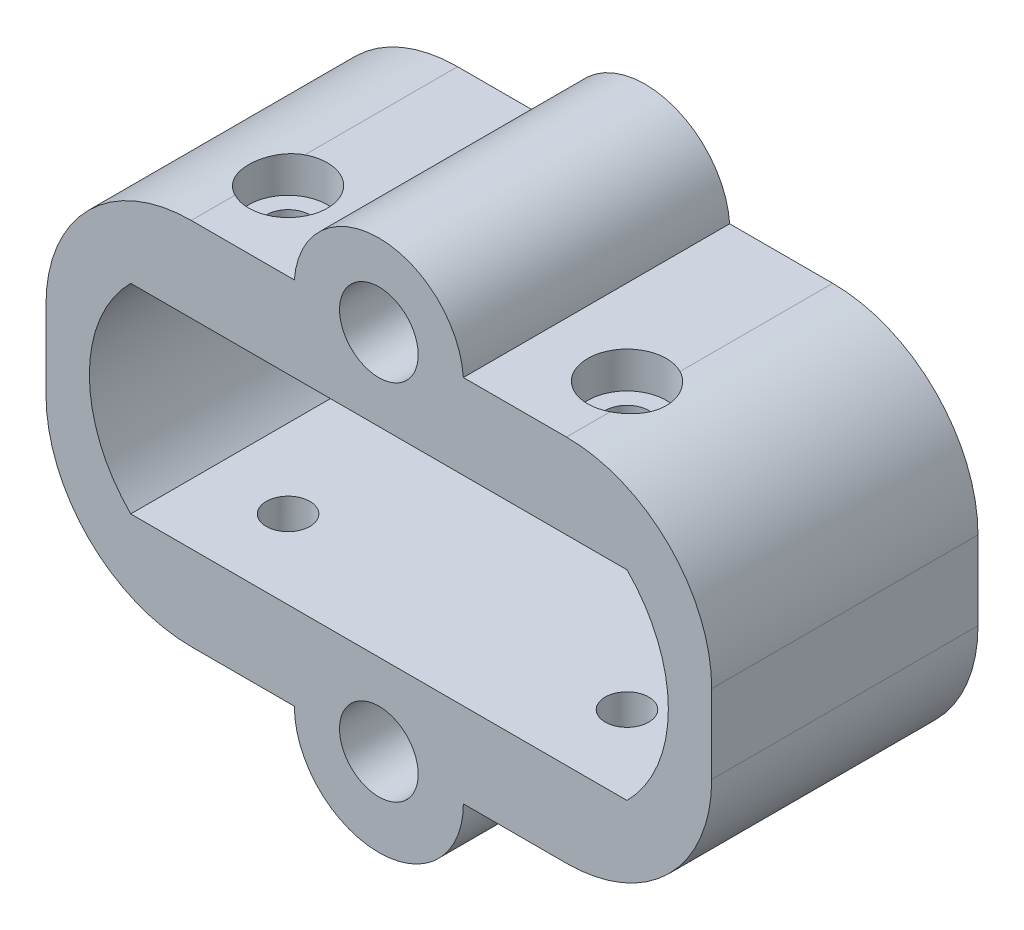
ISO-10303-21;
HEADER;
FILE_DESCRIPTION(('STEP AP214'),'2;1');
FILE_NAME('part.step','',(''),(''),'','','');
FILE_SCHEMA(('AUTOMOTIVE_DESIGN { 1 0 10303 214 1 1 1 1 }'));
ENDSEC;
DATA;
#1=APPLICATION_CONTEXT('core data for automotive mechanical design processes');
#2=APPLICATION_PROTOCOL_DEFINITION('international standard','automotive_design',2000,#1);
#3=PRODUCT_CONTEXT('',#1,'mechanical');
#4=PRODUCT('Part','Part','',(#3));
#5=PRODUCT_RELATED_PRODUCT_CATEGORY('part','',(#4));
#6=PRODUCT_DEFINITION_FORMATION('','',#4);
#7=PRODUCT_DEFINITION_CONTEXT('part definition',#1,'design');
#8=PRODUCT_DEFINITION('design','',#6,#7);
#9=PRODUCT_DEFINITION_SHAPE('','',#8);
#10=(LENGTH_UNIT() NAMED_UNIT(*) SI_UNIT(.MILLI.,.METRE.));
#11=(NAMED_UNIT(*) PLANE_ANGLE_UNIT() SI_UNIT($,.RADIAN.));
#12=(NAMED_UNIT(*) SI_UNIT($,.STERADIAN.) SOLID_ANGLE_UNIT());
#13=UNCERTAINTY_MEASURE_WITH_UNIT(LENGTH_MEASURE(1.E-05),#10,'distance_accuracy_value','');
#14=(GEOMETRIC_REPRESENTATION_CONTEXT(3) GLOBAL_UNCERTAINTY_ASSIGNED_CONTEXT((#13)) GLOBAL_UNIT_ASSIGNED_CONTEXT((#10,
#11,#12)) REPRESENTATION_CONTEXT('',''));
#15=CARTESIAN_POINT('',(0.,0.,0.));
#16=DIRECTION('',(0.,0.,1.));
#17=DIRECTION('',(1.,0.,0.));
#18=AXIS2_PLACEMENT_3D('',#15,#16,#17);
#19=CARTESIAN_POINT('',(0.,14.75,22.));
#20=DIRECTION('',(0.,0.,1.));
#21=DIRECTION('',(1.,0.,0.));
#22=AXIS2_PLACEMENT_3D('',#19,#20,#21);
#23=PLANE('',#22);
#24=CARTESIAN_POINT('',(0.,15.,22.));
#25=DIRECTION('',(0.,0.,1.));
#26=DIRECTION('',(1.,0.,0.));
#27=AXIS2_PLACEMENT_3D('',#24,#25,#26);
#28=CIRCLE('',#27,3.25);
#29=CARTESIAN_POINT('',(3.25,15.,22.));
#30=VERTEX_POINT('',#29);
#31=EDGE_CURVE('E487',#30,#30,#28,.T.);
#32=ORIENTED_EDGE('',*,*,#31,.F.);
#33=EDGE_LOOP('',(#32));
#34=FACE_BOUND('',#33,.T.);
#35=CARTESIAN_POINT('',(0.,-15.,22.));
#36=DIRECTION('',(0.,0.,1.));
#37=DIRECTION('',(1.,0.,0.));
#38=AXIS2_PLACEMENT_3D('',#35,#36,#37);
#39=CIRCLE('',#38,3.25);
#40=CARTESIAN_POINT('',(3.25,-15.,22.));
#41=VERTEX_POINT('',#40);
#42=EDGE_CURVE('E499',#41,#41,#39,.T.);
#43=ORIENTED_EDGE('',*,*,#42,.F.);
#44=EDGE_LOOP('',(#43));
#45=FACE_BOUND('',#44,.T.);
#46=CARTESIAN_POINT('',(0.,14.75,22.));
#47=DIRECTION('',(0.,0.,1.));
#48=DIRECTION('',(1.,0.,0.));
#49=AXIS2_PLACEMENT_3D('',#46,#47,#48);
#50=CIRCLE('',#49,7.);
#51=CARTESIAN_POINT('',(6.98212002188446,15.25,22.));
#52=VERTEX_POINT('',#51);
#53=CARTESIAN_POINT('',(-6.98212002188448,15.25,22.));
#54=VERTEX_POINT('',#53);
#55=EDGE_CURVE('E413',#52,#54,#50,.T.);
#56=ORIENTED_EDGE('',*,*,#55,.T.);
#57=DIRECTION('',(-1.,0.,0.));
#58=VECTOR('',#57,1.);
#59=CARTESIAN_POINT('',(-15.4999999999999,15.25,22.));
#60=LINE('',#59,#58);
#61=CARTESIAN_POINT('',(-15.4999999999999,15.25,22.));
#62=VERTEX_POINT('',#61);
#63=EDGE_CURVE('E416',#54,#62,#60,.T.);
#64=ORIENTED_EDGE('',*,*,#63,.T.);
#65=CARTESIAN_POINT('',(-15.5,3.25,22.));
#66=DIRECTION('',(0.,0.,1.));
#67=DIRECTION('',(1.,0.,0.));
#68=AXIS2_PLACEMENT_3D('',#65,#66,#67);
#69=CIRCLE('',#68,12.);
#70=CARTESIAN_POINT('',(-27.5,3.24999999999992,22.));
#71=VERTEX_POINT('',#70);
#72=EDGE_CURVE('E421',#62,#71,#69,.T.);
#73=ORIENTED_EDGE('',*,*,#72,.T.);
#74=DIRECTION('',(0.,-1.,0.));
#75=VECTOR('',#74,1.);
#76=CARTESIAN_POINT('',(-27.5,-3.24999999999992,22.));
#77=LINE('',#76,#75);
#78=CARTESIAN_POINT('',(-27.5,-3.24999999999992,22.));
#79=VERTEX_POINT('',#78);
#80=EDGE_CURVE('E428',#71,#79,#77,.T.);
#81=ORIENTED_EDGE('',*,*,#80,.T.);
#82=CARTESIAN_POINT('',(-15.5,-3.25,22.));
#83=DIRECTION('',(0.,0.,1.));
#84=DIRECTION('',(-1.,0.,0.));
#85=AXIS2_PLACEMENT_3D('',#82,#83,#84);
#86=CIRCLE('',#85,12.);
#87=CARTESIAN_POINT('',(-15.4999999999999,-15.25,22.));
#88=VERTEX_POINT('',#87);
#89=EDGE_CURVE('E394',#79,#88,#86,.T.);
#90=ORIENTED_EDGE('',*,*,#89,.T.);
#91=DIRECTION('',(1.,0.,0.));
#92=VECTOR('',#91,1.);
#93=CARTESIAN_POINT('',(-15.4999999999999,-15.25,22.));
#94=LINE('',#93,#92);
#95=CARTESIAN_POINT('',(-6.98212002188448,-15.25,22.));
#96=VERTEX_POINT('',#95);
#97=EDGE_CURVE('E431',#88,#96,#94,.T.);
#98=ORIENTED_EDGE('',*,*,#97,.T.);
#99=CARTESIAN_POINT('',(0.,-15.25,22.));
#100=DIRECTION('',(0.,0.,1.));
#101=DIRECTION('',(1.,0.,0.));
#102=AXIS2_PLACEMENT_3D('',#99,#100,#101);
#103=CIRCLE('',#102,6.98212002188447);
#104=CARTESIAN_POINT('',(6.98212002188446,-15.25,22.));
#105=VERTEX_POINT('',#104);
#106=EDGE_CURVE('E433',#96,#105,#103,.T.);
#107=ORIENTED_EDGE('',*,*,#106,.T.);
#108=DIRECTION('',(1.,0.,0.));
#109=VECTOR('',#108,1.);
#110=CARTESIAN_POINT('',(6.98212002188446,-15.25,22.));
#111=LINE('',#110,#109);
#112=CARTESIAN_POINT('',(15.4999999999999,-15.25,22.));
#113=VERTEX_POINT('',#112);
#114=EDGE_CURVE('E435',#105,#113,#111,.T.);
#115=ORIENTED_EDGE('',*,*,#114,.T.);
#116=CARTESIAN_POINT('',(15.5,-3.25,22.));
#117=DIRECTION('',(0.,0.,1.));
#118=DIRECTION('',(-1.,0.,0.));
#119=AXIS2_PLACEMENT_3D('',#116,#117,#118);
#120=CIRCLE('',#119,12.);
#121=CARTESIAN_POINT('',(27.5,-3.24999999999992,22.));
#122=VERTEX_POINT('',#121);
#123=EDGE_CURVE('E437',#113,#122,#120,.T.);
#124=ORIENTED_EDGE('',*,*,#123,.T.);
#125=DIRECTION('',(0.,1.,0.));
#126=VECTOR('',#125,1.);
#127=CARTESIAN_POINT('',(27.5,-3.24999999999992,22.));
#128=LINE('',#127,#126);
#129=CARTESIAN_POINT('',(27.5,3.24999999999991,22.));
#130=VERTEX_POINT('',#129);
#131=EDGE_CURVE('E439',#122,#130,#128,.T.);
#132=ORIENTED_EDGE('',*,*,#131,.T.);
#133=CARTESIAN_POINT('',(15.5,3.25,22.));
#134=DIRECTION('',(0.,0.,1.));
#135=DIRECTION('',(-1.,0.,0.));
#136=AXIS2_PLACEMENT_3D('',#133,#134,#135);
#137=CIRCLE('',#136,12.);
#138=CARTESIAN_POINT('',(15.4999999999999,15.25,22.));
#139=VERTEX_POINT('',#138);
#140=EDGE_CURVE('E441',#130,#139,#137,.T.);
#141=ORIENTED_EDGE('',*,*,#140,.T.);
#142=DIRECTION('',(-1.,0.,0.));
#143=VECTOR('',#142,1.);
#144=CARTESIAN_POINT('',(6.98212002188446,15.25,22.));
#145=LINE('',#144,#143);
#146=EDGE_CURVE('E190',#139,#52,#145,.T.);
#147=ORIENTED_EDGE('',*,*,#146,.T.);
#148=EDGE_LOOP('',(#56,#64,#73,#81,#90,#98,#107,#115,#124,#132,#141,#147));
#149=FACE_BOUND('',#148,.T.);
#150=DIRECTION('',(-1.,0.,0.));
#151=VECTOR('',#150,1.);
#152=CARTESIAN_POINT('',(-20.5,8.25,22.));
#153=LINE('',#152,#151);
#154=CARTESIAN_POINT('',(20.5,8.25,22.));
#155=VERTEX_POINT('',#154);
#156=CARTESIAN_POINT('',(-20.5,8.25,22.));
#157=VERTEX_POINT('',#156);
#158=EDGE_CURVE('E514',#155,#157,#153,.T.);
#159=ORIENTED_EDGE('',*,*,#158,.F.);
#160=CARTESIAN_POINT('',(12.25,0.,22.));
#161=DIRECTION('',(0.,0.,1.));
#162=DIRECTION('',(-1.,0.,0.));
#163=AXIS2_PLACEMENT_3D('',#160,#161,#162);
#164=CIRCLE('',#163,11.667261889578);
#165=CARTESIAN_POINT('',(20.5,-8.25,22.));
#166=VERTEX_POINT('',#165);
#167=EDGE_CURVE('E512',#166,#155,#164,.T.);
#168=ORIENTED_EDGE('',*,*,#167,.F.);
#169=DIRECTION('',(1.,0.,0.));
#170=VECTOR('',#169,1.);
#171=CARTESIAN_POINT('',(-20.5,-8.25,22.));
#172=LINE('',#171,#170);
#173=CARTESIAN_POINT('',(-20.5,-8.25,22.));
#174=VERTEX_POINT('',#173);
#175=EDGE_CURVE('E520',#174,#166,#172,.T.);
#176=ORIENTED_EDGE('',*,*,#175,.F.);
#177=CARTESIAN_POINT('',(-12.25,0.,22.));
#178=DIRECTION('',(0.,0.,1.));
#179=DIRECTION('',(1.,0.,0.));
#180=AXIS2_PLACEMENT_3D('',#177,#178,#179);
#181=CIRCLE('',#180,11.667261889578);
#182=EDGE_CURVE('E517',#157,#174,#181,.T.);
#183=ORIENTED_EDGE('',*,*,#182,.F.);
#184=EDGE_LOOP('',(#159,#168,#176,#183));
#185=FACE_BOUND('',#184,.T.);
#186=ADVANCED_FACE('F34',(#34,#45,#149,#185),#23,.T.);
#187=CARTESIAN_POINT('',(0.,14.75,0.));
#188=DIRECTION('',(0.,0.,1.));
#189=DIRECTION('',(1.,0.,0.));
#190=AXIS2_PLACEMENT_3D('',#187,#188,#189);
#191=PLANE('',#190);
#192=CARTESIAN_POINT('',(0.,15.,0.));
#193=DIRECTION('',(0.,0.,1.));
#194=DIRECTION('',(1.,0.,0.));
#195=AXIS2_PLACEMENT_3D('',#192,#193,#194);
#196=CIRCLE('',#195,1.79999999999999);
#197=CARTESIAN_POINT('',(1.79999999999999,15.,0.));
#198=VERTEX_POINT('',#197);
#199=EDGE_CURVE('E496',#198,#198,#196,.T.);
#200=ORIENTED_EDGE('',*,*,#199,.T.);
#201=EDGE_LOOP('',(#200));
#202=FACE_BOUND('',#201,.T.);
#203=CARTESIAN_POINT('',(0.,-15.,0.));
#204=DIRECTION('',(0.,0.,1.));
#205=DIRECTION('',(1.,0.,0.));
#206=AXIS2_PLACEMENT_3D('',#203,#204,#205);
#207=CIRCLE('',#206,1.79999999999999);
#208=CARTESIAN_POINT('',(1.8,-15.,0.));
#209=VERTEX_POINT('',#208);
#210=EDGE_CURVE('E508',#209,#209,#207,.T.);
#211=ORIENTED_EDGE('',*,*,#210,.T.);
#212=EDGE_LOOP('',(#211));
#213=FACE_BOUND('',#212,.T.);
#214=CARTESIAN_POINT('',(0.,14.75,0.));
#215=DIRECTION('',(0.,0.,1.));
#216=DIRECTION('',(1.,0.,0.));
#217=AXIS2_PLACEMENT_3D('',#214,#215,#216);
#218=CIRCLE('',#217,7.);
#219=CARTESIAN_POINT('',(6.98212002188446,15.25,0.));
#220=VERTEX_POINT('',#219);
#221=CARTESIAN_POINT('',(-6.98212002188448,15.25,0.));
#222=VERTEX_POINT('',#221);
#223=EDGE_CURVE('E444',#220,#222,#218,.T.);
#224=ORIENTED_EDGE('',*,*,#223,.F.);
#225=DIRECTION('',(-1.,0.,0.));
#226=VECTOR('',#225,1.);
#227=CARTESIAN_POINT('',(6.98212002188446,15.25,0.));
#228=LINE('',#227,#226);
#229=CARTESIAN_POINT('',(15.4999999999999,15.25,0.));
#230=VERTEX_POINT('',#229);
#231=EDGE_CURVE('E412',#230,#220,#228,.T.);
#232=ORIENTED_EDGE('',*,*,#231,.F.);
#233=CARTESIAN_POINT('',(15.5,3.25,0.));
#234=DIRECTION('',(0.,0.,1.));
#235=DIRECTION('',(-1.,0.,0.));
#236=AXIS2_PLACEMENT_3D('',#233,#234,#235);
#237=CIRCLE('',#236,12.);
#238=CARTESIAN_POINT('',(27.5,3.24999999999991,0.));
#239=VERTEX_POINT('',#238);
#240=EDGE_CURVE('E184',#239,#230,#237,.T.);
#241=ORIENTED_EDGE('',*,*,#240,.F.);
#242=DIRECTION('',(0.,1.,0.));
#243=VECTOR('',#242,1.);
#244=CARTESIAN_POINT('',(27.5,-3.24999999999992,0.));
#245=LINE('',#244,#243);
#246=CARTESIAN_POINT('',(27.5,-3.24999999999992,0.));
#247=VERTEX_POINT('',#246);
#248=EDGE_CURVE('E410',#247,#239,#245,.T.);
#249=ORIENTED_EDGE('',*,*,#248,.F.);
#250=CARTESIAN_POINT('',(15.5,-3.25,0.));
#251=DIRECTION('',(0.,0.,1.));
#252=DIRECTION('',(-1.,0.,0.));
#253=AXIS2_PLACEMENT_3D('',#250,#251,#252);
#254=CIRCLE('',#253,12.);
#255=CARTESIAN_POINT('',(15.4999999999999,-15.25,0.));
#256=VERTEX_POINT('',#255);
#257=EDGE_CURVE('E408',#256,#247,#254,.T.);
#258=ORIENTED_EDGE('',*,*,#257,.F.);
#259=DIRECTION('',(1.,0.,0.));
#260=VECTOR('',#259,1.);
#261=CARTESIAN_POINT('',(6.98212002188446,-15.25,0.));
#262=LINE('',#261,#260);
#263=CARTESIAN_POINT('',(6.98212002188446,-15.25,0.));
#264=VERTEX_POINT('',#263);
#265=EDGE_CURVE('E405',#264,#256,#262,.T.);
#266=ORIENTED_EDGE('',*,*,#265,.F.);
#267=CARTESIAN_POINT('',(0.,-15.25,0.));
#268=DIRECTION('',(0.,0.,1.));
#269=DIRECTION('',(1.,0.,0.));
#270=AXIS2_PLACEMENT_3D('',#267,#268,#269);
#271=CIRCLE('',#270,6.98212002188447);
#272=CARTESIAN_POINT('',(-6.98212002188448,-15.25,0.));
#273=VERTEX_POINT('',#272);
#274=EDGE_CURVE('E400',#273,#264,#271,.T.);
#275=ORIENTED_EDGE('',*,*,#274,.F.);
#276=DIRECTION('',(1.,0.,0.));
#277=VECTOR('',#276,1.);
#278=CARTESIAN_POINT('',(-15.4999999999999,-15.25,0.));
#279=LINE('',#278,#277);
#280=CARTESIAN_POINT('',(-15.4999999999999,-15.25,0.));
#281=VERTEX_POINT('',#280);
#282=EDGE_CURVE('E398',#281,#273,#279,.T.);
#283=ORIENTED_EDGE('',*,*,#282,.F.);
#284=CARTESIAN_POINT('',(-15.5,-3.25,0.));
#285=DIRECTION('',(0.,0.,1.));
#286=DIRECTION('',(-1.,0.,0.));
#287=AXIS2_PLACEMENT_3D('',#284,#285,#286);
#288=CIRCLE('',#287,12.);
#289=CARTESIAN_POINT('',(-27.5,-3.24999999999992,0.));
#290=VERTEX_POINT('',#289);
#291=EDGE_CURVE('E387',#290,#281,#288,.T.);
#292=ORIENTED_EDGE('',*,*,#291,.F.);
#293=DIRECTION('',(0.,-1.,0.));
#294=VECTOR('',#293,1.);
#295=CARTESIAN_POINT('',(-27.5,-3.24999999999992,0.));
#296=LINE('',#295,#294);
#297=CARTESIAN_POINT('',(-27.5,3.24999999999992,0.));
#298=VERTEX_POINT('',#297);
#299=EDGE_CURVE('E380',#298,#290,#296,.T.);
#300=ORIENTED_EDGE('',*,*,#299,.F.);
#301=CARTESIAN_POINT('',(-15.5,3.25,0.));
#302=DIRECTION('',(0.,0.,1.));
#303=DIRECTION('',(1.,0.,0.));
#304=AXIS2_PLACEMENT_3D('',#301,#302,#303);
#305=CIRCLE('',#304,12.);
#306=CARTESIAN_POINT('',(-15.4999999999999,15.25,0.));
#307=VERTEX_POINT('',#306);
#308=EDGE_CURVE('E388',#307,#298,#305,.T.);
#309=ORIENTED_EDGE('',*,*,#308,.F.);
#310=DIRECTION('',(-1.,0.,0.));
#311=VECTOR('',#310,1.);
#312=CARTESIAN_POINT('',(-15.4999999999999,15.25,0.));
#313=LINE('',#312,#311);
#314=EDGE_CURVE('E447',#222,#307,#313,.T.);
#315=ORIENTED_EDGE('',*,*,#314,.F.);
#316=EDGE_LOOP('',(#224,#232,#241,#249,#258,#266,#275,#283,#292,#300,#309,#315));
#317=FACE_BOUND('',#316,.T.);
#318=CARTESIAN_POINT('',(12.25,0.,0.));
#319=DIRECTION('',(0.,0.,1.));
#320=DIRECTION('',(-1.,0.,0.));
#321=AXIS2_PLACEMENT_3D('',#318,#319,#320);
#322=CIRCLE('',#321,11.667261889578);
#323=CARTESIAN_POINT('',(20.5,-8.25,0.));
#324=VERTEX_POINT('',#323);
#325=CARTESIAN_POINT('',(20.5,8.25,0.));
#326=VERTEX_POINT('',#325);
#327=EDGE_CURVE('E511',#324,#326,#322,.T.);
#328=ORIENTED_EDGE('',*,*,#327,.T.);
#329=DIRECTION('',(-1.,0.,0.));
#330=VECTOR('',#329,1.);
#331=CARTESIAN_POINT('',(-20.5,8.25,0.));
#332=LINE('',#331,#330);
#333=CARTESIAN_POINT('',(-20.5,8.25,0.));
#334=VERTEX_POINT('',#333);
#335=EDGE_CURVE('E525',#326,#334,#332,.T.);
#336=ORIENTED_EDGE('',*,*,#335,.T.);
#337=CARTESIAN_POINT('',(-12.25,0.,0.));
#338=DIRECTION('',(0.,0.,1.));
#339=DIRECTION('',(1.,0.,0.));
#340=AXIS2_PLACEMENT_3D('',#337,#338,#339);
#341=CIRCLE('',#340,11.667261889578);
#342=CARTESIAN_POINT('',(-20.5,-8.25,0.));
#343=VERTEX_POINT('',#342);
#344=EDGE_CURVE('E528',#334,#343,#341,.T.);
#345=ORIENTED_EDGE('',*,*,#344,.T.);
#346=DIRECTION('',(1.,0.,0.));
#347=VECTOR('',#346,1.);
#348=CARTESIAN_POINT('',(-20.5,-8.25,0.));
#349=LINE('',#348,#347);
#350=EDGE_CURVE('E515',#343,#324,#349,.T.);
#351=ORIENTED_EDGE('',*,*,#350,.T.);
#352=EDGE_LOOP('',(#328,#336,#345,#351));
#353=FACE_BOUND('',#352,.T.);
#354=ADVANCED_FACE('F303',(#202,#213,#317,#353),#191,.F.);
#355=CARTESIAN_POINT('',(0.,14.75,22.));
#356=DIRECTION('',(0.,0.,-1.));
#357=DIRECTION('',(-1.,0.,0.));
#358=AXIS2_PLACEMENT_3D('',#355,#356,#357);
#359=CYLINDRICAL_SURFACE('',#358,7.);
#360=ORIENTED_EDGE('',*,*,#223,.T.);
#361=DIRECTION('',(0.,0.,-1.));
#362=VECTOR('',#361,1.);
#363=CARTESIAN_POINT('',(-6.98212002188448,15.25,22.));
#364=LINE('',#363,#362);
#365=EDGE_CURVE('E222',#54,#222,#364,.T.);
#366=ORIENTED_EDGE('',*,*,#365,.F.);
#367=ORIENTED_EDGE('',*,*,#55,.F.);
#368=DIRECTION('',(0.,0.,-1.));
#369=VECTOR('',#368,1.);
#370=CARTESIAN_POINT('',(6.98212002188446,15.25,22.));
#371=LINE('',#370,#369);
#372=EDGE_CURVE('E186',#52,#220,#371,.T.);
#373=ORIENTED_EDGE('',*,*,#372,.T.);
#374=EDGE_LOOP('',(#360,#366,#367,#373));
#375=FACE_BOUND('',#374,.T.);
#376=ADVANCED_FACE('F36',(#375),#359,.T.);
#377=CARTESIAN_POINT('',(-15.4999999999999,15.25,22.));
#378=DIRECTION('',(0.,-1.,0.));
#379=DIRECTION('',(0.,0.,-1.));
#380=AXIS2_PLACEMENT_3D('',#377,#378,#379);
#381=PLANE('',#380);
#382=DIRECTION('',(0.,0.,-1.));
#383=VECTOR('',#382,1.);
#384=CARTESIAN_POINT('',(-15.4999999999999,15.25,22.));
#385=LINE('',#384,#383);
#386=CARTESIAN_POINT('',(-15.4999999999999,15.25,12.6168593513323));
#387=VERTEX_POINT('',#386);
#388=EDGE_CURVE('E218',#387,#307,#385,.T.);
#389=ORIENTED_EDGE('',*,*,#388,.F.);
#390=CARTESIAN_POINT('',(-14.,15.25,15.5));
#391=DIRECTION('',(0.,1.,0.));
#392=DIRECTION('',(0.,0.,1.));
#393=AXIS2_PLACEMENT_3D('',#390,#391,#392);
#394=CIRCLE('',#393,3.25);
#395=CARTESIAN_POINT('',(-15.5,15.25,18.3831406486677));
#396=VERTEX_POINT('',#395);
#397=EDGE_CURVE('E572',#396,#387,#394,.T.);
#398=ORIENTED_EDGE('',*,*,#397,.F.);
#399=EDGE_CURVE('E219',#62,#396,#385,.T.);
#400=ORIENTED_EDGE('',*,*,#399,.F.);
#401=ORIENTED_EDGE('',*,*,#63,.F.);
#402=ORIENTED_EDGE('',*,*,#365,.T.);
#403=ORIENTED_EDGE('',*,*,#314,.T.);
#404=EDGE_LOOP('',(#389,#398,#400,#401,#402,#403));
#405=FACE_BOUND('',#404,.T.);
#406=ADVANCED_FACE('F376',(#405),#381,.F.);
#407=CARTESIAN_POINT('',(-15.5,3.25,22.));
#408=DIRECTION('',(0.,0.,-1.));
#409=DIRECTION('',(-1.,0.,0.));
#410=AXIS2_PLACEMENT_3D('',#407,#408,#409);
#411=CYLINDRICAL_SURFACE('',#410,12.);
#412=ORIENTED_EDGE('',*,*,#399,.T.);
#413=CARTESIAN_POINT('',(-15.4999999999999,15.25,18.3831406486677));
#414=CARTESIAN_POINT('',(-15.5807260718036,15.2500049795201,18.3411523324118));
#415=CARTESIAN_POINT('',(-15.6596718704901,15.249185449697,18.2957612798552));
#416=CARTESIAN_POINT('',(-15.8134520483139,15.2461506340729,18.1985457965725));
#417=CARTESIAN_POINT('',(-15.8882871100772,15.2439355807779,18.1467224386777));
#418=CARTESIAN_POINT('',(-16.0332417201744,15.238365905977,18.0370610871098));
#419=CARTESIAN_POINT('',(-16.1033664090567,15.2350125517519,17.9792298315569));
#420=CARTESIAN_POINT('',(-16.2384912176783,15.2274459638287,17.857946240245));
#421=CARTESIAN_POINT('',(-16.303491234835,15.2232327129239,17.794493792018));
#422=CARTESIAN_POINT('',(-16.4901181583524,15.2097327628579,17.5963443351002));
#423=CARTESIAN_POINT('',(-16.6035022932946,15.1995799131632,17.453756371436));
#424=CARTESIAN_POINT('',(-16.8048504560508,15.1792776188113,17.1517561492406));
#425=CARTESIAN_POINT('',(-16.8928149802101,15.1691281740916,16.9923442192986));
#426=CARTESIAN_POINT('',(-17.0415973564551,15.1508051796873,16.6595894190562));
#427=CARTESIAN_POINT('',(-17.1021858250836,15.1426485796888,16.4861426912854));
#428=CARTESIAN_POINT('',(-17.1933347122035,15.1300152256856,16.1313928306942));
#429=CARTESIAN_POINT('',(-17.2238943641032,15.1255385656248,15.9500894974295));
#430=CARTESIAN_POINT('',(-17.2539385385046,15.1211386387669,15.5862712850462));
#431=CARTESIAN_POINT('',(-17.2536595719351,15.1211807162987,15.4037763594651));
#432=CARTESIAN_POINT('',(-17.2226239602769,15.1257233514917,15.0414699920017));
#433=CARTESIAN_POINT('',(-17.1918696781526,15.1302235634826,14.8616583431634));
#434=CARTESIAN_POINT('',(-17.101034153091,15.1428028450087,14.5106555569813));
#435=CARTESIAN_POINT('',(-17.0410919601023,15.150864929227,14.3394277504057));
#436=CARTESIAN_POINT('',(-16.89363662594,15.1690294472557,14.0093467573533));
#437=CARTESIAN_POINT('',(-16.8061153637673,15.1791324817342,13.8504972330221));
#438=CARTESIAN_POINT('',(-16.6049233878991,15.1994540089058,13.5480220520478));
#439=CARTESIAN_POINT('',(-16.4909976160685,15.2096726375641,13.4045662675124));
#440=CARTESIAN_POINT('',(-16.2406551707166,15.2277745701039,13.1388137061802));
#441=CARTESIAN_POINT('',(-16.1042635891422,15.235660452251,13.0164936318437));
#442=CARTESIAN_POINT('',(-15.8863830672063,15.2439968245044,12.8519260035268));
#443=CARTESIAN_POINT('',(-15.8118260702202,15.2461918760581,12.8003707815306));
#444=CARTESIAN_POINT('',(-15.6587710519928,15.2491938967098,12.7037256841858));
#445=CARTESIAN_POINT('',(-15.5802793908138,15.2500030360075,12.6586258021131));
#446=CARTESIAN_POINT('',(-15.4999999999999,15.25,12.6168593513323));
#447=B_SPLINE_CURVE_WITH_KNOTS('',3,(#413,#414,#415,#416,#417,#418,#419,#420,#421,#422,#423,
#424,#425,#426,#427,#428,#429,#430,#431,#432,#433,#434,#435,#436,#437,#438,#439,#440,#441,#442,
#443,#444,#445,#446),.UNSPECIFIED.,.F.,.F.,(4,2,2,2,2,2,2,2,2,2,2,2,2,2,2,2,4),(0.,
0.272880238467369,0.545715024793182,0.818247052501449,1.09078453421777,1.63537453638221,
2.17995390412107,2.72901531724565,3.27809074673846,3.8229554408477,4.36777789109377,
4.91002985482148,5.45244164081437,6.00032904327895,6.54760861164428,6.81934296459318,
7.09065141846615),.UNSPECIFIED.);
#448=EDGE_CURVE('E225',#396,#387,#447,.T.);
#449=ORIENTED_EDGE('',*,*,#448,.T.);
#450=ORIENTED_EDGE('',*,*,#388,.T.);
#451=ORIENTED_EDGE('',*,*,#308,.T.);
#452=DIRECTION('',(0.,0.,-1.));
#453=VECTOR('',#452,1.);
#454=CARTESIAN_POINT('',(-27.5,3.24999999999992,22.));
#455=LINE('',#454,#453);
#456=EDGE_CURVE('E215',#71,#298,#455,.T.);
#457=ORIENTED_EDGE('',*,*,#456,.F.);
#458=ORIENTED_EDGE('',*,*,#72,.F.);
#459=EDGE_LOOP('',(#412,#449,#450,#451,#457,#458));
#460=FACE_BOUND('',#459,.T.);
#461=ADVANCED_FACE('F240',(#460),#411,.T.);
#462=CARTESIAN_POINT('',(-27.5,-3.24999999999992,22.));
#463=DIRECTION('',(1.,0.,0.));
#464=DIRECTION('',(0.,0.,-1.));
#465=AXIS2_PLACEMENT_3D('',#462,#463,#464);
#466=PLANE('',#465);
#467=ORIENTED_EDGE('',*,*,#299,.T.);
#468=DIRECTION('',(0.,0.,-1.));
#469=VECTOR('',#468,1.);
#470=CARTESIAN_POINT('',(-27.5,-3.24999999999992,22.));
#471=LINE('',#470,#469);
#472=EDGE_CURVE('E212',#79,#290,#471,.T.);
#473=ORIENTED_EDGE('',*,*,#472,.F.);
#474=ORIENTED_EDGE('',*,*,#80,.F.);
#475=ORIENTED_EDGE('',*,*,#456,.T.);
#476=EDGE_LOOP('',(#467,#473,#474,#475));
#477=FACE_BOUND('',#476,.T.);
#478=ADVANCED_FACE('F369',(#477),#466,.F.);
#479=CARTESIAN_POINT('',(-15.5,-3.25,22.));
#480=DIRECTION('',(0.,0.,-1.));
#481=DIRECTION('',(-1.,0.,0.));
#482=AXIS2_PLACEMENT_3D('',#479,#480,#481);
#483=CYLINDRICAL_SURFACE('',#482,12.);
#484=DIRECTION('',(0.,0.,-1.));
#485=VECTOR('',#484,1.);
#486=CARTESIAN_POINT('',(-15.4999999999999,-15.25,22.));
#487=LINE('',#486,#485);
#488=CARTESIAN_POINT('',(-15.4999999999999,-15.25,14.5050125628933));
#489=VERTEX_POINT('',#488);
#490=EDGE_CURVE('E208',#489,#281,#487,.T.);
#491=ORIENTED_EDGE('',*,*,#490,.F.);
#492=CARTESIAN_POINT('',(-15.4999999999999,-15.25,14.5050125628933));
#493=CARTESIAN_POINT('',(-15.5279920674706,-15.2499992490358,14.5472128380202));
#494=CARTESIAN_POINT('',(-15.5541892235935,-15.2499021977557,14.5905743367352));
#495=CARTESIAN_POINT('',(-15.6028386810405,-15.2495840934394,14.6793462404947));
#496=CARTESIAN_POINT('',(-15.6252911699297,-15.2493630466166,14.7247565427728));
#497=CARTESIAN_POINT('',(-15.6867348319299,-15.2486176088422,14.8635028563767));
#498=CARTESIAN_POINT('',(-15.7199063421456,-15.248010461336,14.9594965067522));
#499=CARTESIAN_POINT('',(-15.7696616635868,-15.2469957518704,15.1556785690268));
#500=CARTESIAN_POINT('',(-15.7862390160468,-15.2465882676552,15.2558685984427));
#501=CARTESIAN_POINT('',(-15.8023423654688,-15.2461933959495,15.4576289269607));
#502=CARTESIAN_POINT('',(-15.8018680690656,-15.2462060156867,15.5591992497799));
#503=CARTESIAN_POINT('',(-15.7838790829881,-15.2466450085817,15.7608278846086));
#504=CARTESIAN_POINT('',(-15.7663599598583,-15.247071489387,15.8608857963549));
#505=CARTESIAN_POINT('',(-15.7147629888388,-15.248105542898,16.0566015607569));
#506=CARTESIAN_POINT('',(-15.6806994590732,-15.2487129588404,16.1522631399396));
#507=CARTESIAN_POINT('',(-15.619111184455,-15.2494248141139,16.2878964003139));
#508=CARTESIAN_POINT('',(-15.5975815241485,-15.2496257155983,16.3306784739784));
#509=CARTESIAN_POINT('',(-15.5512295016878,-15.249912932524,16.4143112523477));
#510=CARTESIAN_POINT('',(-15.526413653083,-15.2499994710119,16.455165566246));
#511=CARTESIAN_POINT('',(-15.4999999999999,-15.25,16.4949874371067));
#512=B_SPLINE_CURVE_WITH_KNOTS('',3,(#492,#493,#494,#495,#496,#497,#498,#499,#500,#501,#502,
#503,#504,#505,#506,#507,#508,#509,#510,#511),.UNSPECIFIED.,.F.,.F.,(4,2,2,2,2,2,2,2,2,4),(0.,
0.151826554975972,0.303645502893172,0.606778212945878,0.910028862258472,1.21328472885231,
1.51661949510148,1.81969221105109,1.96324605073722,2.10651949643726),.UNSPECIFIED.);
#513=CARTESIAN_POINT('',(-15.4999999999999,-15.25,16.4949874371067));
#514=VERTEX_POINT('',#513);
#515=EDGE_CURVE('E43',#489,#514,#512,.T.);
#516=ORIENTED_EDGE('',*,*,#515,.T.);
#517=EDGE_CURVE('E209',#88,#514,#487,.T.);
#518=ORIENTED_EDGE('',*,*,#517,.F.);
#519=ORIENTED_EDGE('',*,*,#89,.F.);
#520=ORIENTED_EDGE('',*,*,#472,.T.);
#521=ORIENTED_EDGE('',*,*,#291,.T.);
#522=EDGE_LOOP('',(#491,#516,#518,#519,#520,#521));
#523=FACE_BOUND('',#522,.T.);
#524=ADVANCED_FACE('F365',(#523),#483,.T.);
#525=CARTESIAN_POINT('',(-15.4999999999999,-15.25,22.));
#526=DIRECTION('',(0.,1.,0.));
#527=DIRECTION('',(0.,0.,1.));
#528=AXIS2_PLACEMENT_3D('',#525,#526,#527);
#529=PLANE('',#528);
#530=ORIENTED_EDGE('',*,*,#517,.T.);
#531=CARTESIAN_POINT('',(-14.,-15.25,15.5));
#532=DIRECTION('',(0.,1.,0.));
#533=DIRECTION('',(0.,0.,1.));
#534=AXIS2_PLACEMENT_3D('',#531,#532,#533);
#535=CIRCLE('',#534,1.8);
#536=EDGE_CURVE('E471',#514,#489,#535,.T.);
#537=ORIENTED_EDGE('',*,*,#536,.T.);
#538=ORIENTED_EDGE('',*,*,#490,.T.);
#539=ORIENTED_EDGE('',*,*,#282,.T.);
#540=DIRECTION('',(0.,0.,-1.));
#541=VECTOR('',#540,1.);
#542=CARTESIAN_POINT('',(-6.98212002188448,-15.25,22.));
#543=LINE('',#542,#541);
#544=EDGE_CURVE('E205',#96,#273,#543,.T.);
#545=ORIENTED_EDGE('',*,*,#544,.F.);
#546=ORIENTED_EDGE('',*,*,#97,.F.);
#547=EDGE_LOOP('',(#530,#537,#538,#539,#545,#546));
#548=FACE_BOUND('',#547,.T.);
#549=ADVANCED_FACE('F362',(#548),#529,.F.);
#550=CARTESIAN_POINT('',(0.,-15.25,22.));
#551=DIRECTION('',(0.,0.,-1.));
#552=DIRECTION('',(-1.,0.,0.));
#553=AXIS2_PLACEMENT_3D('',#550,#551,#552);
#554=CYLINDRICAL_SURFACE('',#553,6.98212002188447);
#555=ORIENTED_EDGE('',*,*,#274,.T.);
#556=DIRECTION('',(0.,0.,-1.));
#557=VECTOR('',#556,1.);
#558=CARTESIAN_POINT('',(6.98212002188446,-15.25,22.));
#559=LINE('',#558,#557);
#560=EDGE_CURVE('E202',#105,#264,#559,.T.);
#561=ORIENTED_EDGE('',*,*,#560,.F.);
#562=ORIENTED_EDGE('',*,*,#106,.F.);
#563=ORIENTED_EDGE('',*,*,#544,.T.);
#564=EDGE_LOOP('',(#555,#561,#562,#563));
#565=FACE_BOUND('',#564,.T.);
#566=ADVANCED_FACE('F358',(#565),#554,.T.);
#567=CARTESIAN_POINT('',(6.98212002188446,-15.25,22.));
#568=DIRECTION('',(0.,1.,0.));
#569=DIRECTION('',(0.,0.,1.));
#570=AXIS2_PLACEMENT_3D('',#567,#568,#569);
#571=PLANE('',#570);
#572=DIRECTION('',(0.,0.,-1.));
#573=VECTOR('',#572,1.);
#574=CARTESIAN_POINT('',(15.4999999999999,-15.25,22.));
#575=LINE('',#574,#573);
#576=CARTESIAN_POINT('',(15.4999999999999,-15.25,14.5050125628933));
#577=VERTEX_POINT('',#576);
#578=EDGE_CURVE('E198',#577,#256,#575,.T.);
#579=ORIENTED_EDGE('',*,*,#578,.F.);
#580=CARTESIAN_POINT('',(14.,-15.25,15.5));
#581=DIRECTION('',(0.,1.,0.));
#582=DIRECTION('',(0.,0.,1.));
#583=AXIS2_PLACEMENT_3D('',#580,#581,#582);
#584=CIRCLE('',#583,1.8);
#585=CARTESIAN_POINT('',(15.4999999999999,-15.25,16.4949874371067));
#586=VERTEX_POINT('',#585);
#587=EDGE_CURVE('E49',#577,#586,#584,.T.);
#588=ORIENTED_EDGE('',*,*,#587,.T.);
#589=EDGE_CURVE('E199',#113,#586,#575,.T.);
#590=ORIENTED_EDGE('',*,*,#589,.F.);
#591=ORIENTED_EDGE('',*,*,#114,.F.);
#592=ORIENTED_EDGE('',*,*,#560,.T.);
#593=ORIENTED_EDGE('',*,*,#265,.T.);
#594=EDGE_LOOP('',(#579,#588,#590,#591,#592,#593));
#595=FACE_BOUND('',#594,.T.);
#596=ADVANCED_FACE('F354',(#595),#571,.F.);
#597=CARTESIAN_POINT('',(15.5,-3.25,22.));
#598=DIRECTION('',(0.,0.,-1.));
#599=DIRECTION('',(-1.,0.,0.));
#600=AXIS2_PLACEMENT_3D('',#597,#598,#599);
#601=CYLINDRICAL_SURFACE('',#600,12.);
#602=ORIENTED_EDGE('',*,*,#589,.T.);
#603=CARTESIAN_POINT('',(15.4999999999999,-15.25,16.4949874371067));
#604=CARTESIAN_POINT('',(15.5279920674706,-15.2499992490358,16.4527871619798));
#605=CARTESIAN_POINT('',(15.5541892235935,-15.2499021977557,16.4094256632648));
#606=CARTESIAN_POINT('',(15.6028386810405,-15.2495840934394,16.3206537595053));
#607=CARTESIAN_POINT('',(15.6252911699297,-15.2493630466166,16.2752434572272));
#608=CARTESIAN_POINT('',(15.6867348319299,-15.2486176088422,16.1364971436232));
#609=CARTESIAN_POINT('',(15.7199063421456,-15.248010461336,16.0405034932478));
#610=CARTESIAN_POINT('',(15.7696616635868,-15.2469957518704,15.8443214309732));
#611=CARTESIAN_POINT('',(15.7862390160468,-15.2465882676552,15.7441314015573));
#612=CARTESIAN_POINT('',(15.8023423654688,-15.2461933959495,15.5423710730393));
#613=CARTESIAN_POINT('',(15.8018680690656,-15.2462060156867,15.4408007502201));
#614=CARTESIAN_POINT('',(15.7838790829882,-15.2466450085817,15.2391721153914));
#615=CARTESIAN_POINT('',(15.7663599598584,-15.247071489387,15.1391142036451));
#616=CARTESIAN_POINT('',(15.7147629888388,-15.248105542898,14.9433984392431));
#617=CARTESIAN_POINT('',(15.6806994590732,-15.2487129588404,14.8477368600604));
#618=CARTESIAN_POINT('',(15.619111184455,-15.2494248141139,14.7121035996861));
#619=CARTESIAN_POINT('',(15.5975815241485,-15.2496257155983,14.6693215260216));
#620=CARTESIAN_POINT('',(15.5512295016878,-15.249912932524,14.5856887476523));
#621=CARTESIAN_POINT('',(15.526413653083,-15.2499994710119,14.544834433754));
#622=CARTESIAN_POINT('',(15.4999999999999,-15.25,14.5050125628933));
#623=B_SPLINE_CURVE_WITH_KNOTS('',3,(#603,#604,#605,#606,#607,#608,#609,#610,#611,#612,#613,
#614,#615,#616,#617,#618,#619,#620,#621,#622),.UNSPECIFIED.,.F.,.F.,(4,2,2,2,2,2,2,2,2,4),(0.,
0.151826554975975,0.303645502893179,0.606778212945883,0.910028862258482,1.21328472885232,
1.51661949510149,1.81969221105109,1.96324605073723,2.10651949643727),.UNSPECIFIED.);
#624=EDGE_CURVE('E343',#586,#577,#623,.T.);
#625=ORIENTED_EDGE('',*,*,#624,.T.);
#626=ORIENTED_EDGE('',*,*,#578,.T.);
#627=ORIENTED_EDGE('',*,*,#257,.T.);
#628=DIRECTION('',(0.,0.,-1.));
#629=VECTOR('',#628,1.);
#630=CARTESIAN_POINT('',(27.5,-3.24999999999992,22.));
#631=LINE('',#630,#629);
#632=EDGE_CURVE('E195',#122,#247,#631,.T.);
#633=ORIENTED_EDGE('',*,*,#632,.F.);
#634=ORIENTED_EDGE('',*,*,#123,.F.);
#635=EDGE_LOOP('',(#602,#625,#626,#627,#633,#634));
#636=FACE_BOUND('',#635,.T.);
#637=ADVANCED_FACE('F350',(#636),#601,.T.);
#638=CARTESIAN_POINT('',(27.5,-3.24999999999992,22.));
#639=DIRECTION('',(-1.,0.,0.));
#640=DIRECTION('',(0.,0.,1.));
#641=AXIS2_PLACEMENT_3D('',#638,#639,#640);
#642=PLANE('',#641);
#643=ORIENTED_EDGE('',*,*,#248,.T.);
#644=DIRECTION('',(0.,0.,-1.));
#645=VECTOR('',#644,1.);
#646=CARTESIAN_POINT('',(27.5,3.24999999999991,22.));
#647=LINE('',#646,#645);
#648=EDGE_CURVE('E188',#130,#239,#647,.T.);
#649=ORIENTED_EDGE('',*,*,#648,.F.);
#650=ORIENTED_EDGE('',*,*,#131,.F.);
#651=ORIENTED_EDGE('',*,*,#632,.T.);
#652=EDGE_LOOP('',(#643,#649,#650,#651));
#653=FACE_BOUND('',#652,.T.);
#654=ADVANCED_FACE('F313',(#653),#642,.F.);
#655=CARTESIAN_POINT('',(15.5,3.25,22.));
#656=DIRECTION('',(0.,0.,-1.));
#657=DIRECTION('',(-1.,0.,0.));
#658=AXIS2_PLACEMENT_3D('',#655,#656,#657);
#659=CYLINDRICAL_SURFACE('',#658,12.);
#660=DIRECTION('',(0.,0.,-1.));
#661=VECTOR('',#660,1.);
#662=CARTESIAN_POINT('',(15.4999999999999,15.25,22.));
#663=LINE('',#662,#661);
#664=CARTESIAN_POINT('',(15.5,15.25,12.6168593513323));
#665=VERTEX_POINT('',#664);
#666=EDGE_CURVE('E175',#665,#230,#663,.T.);
#667=ORIENTED_EDGE('',*,*,#666,.F.);
#668=CARTESIAN_POINT('',(15.4999999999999,15.25,12.6168593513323));
#669=CARTESIAN_POINT('',(15.5807260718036,15.2500049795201,12.6588476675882));
#670=CARTESIAN_POINT('',(15.6596718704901,15.249185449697,12.7042387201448));
#671=CARTESIAN_POINT('',(15.8134520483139,15.2461506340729,12.8014542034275));
#672=CARTESIAN_POINT('',(15.8882871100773,15.2439355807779,12.8532775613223));
#673=CARTESIAN_POINT('',(16.0332417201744,15.238365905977,12.9629389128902));
#674=CARTESIAN_POINT('',(16.1033664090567,15.2350125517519,13.0207701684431));
#675=CARTESIAN_POINT('',(16.2384912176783,15.2274459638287,13.142053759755));
#676=CARTESIAN_POINT('',(16.303491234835,15.2232327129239,13.205506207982));
#677=CARTESIAN_POINT('',(16.4901181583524,15.2097327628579,13.4036556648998));
#678=CARTESIAN_POINT('',(16.6035022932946,15.1995799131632,13.546243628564));
#679=CARTESIAN_POINT('',(16.8048504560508,15.1792776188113,13.8482438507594));
#680=CARTESIAN_POINT('',(16.8928149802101,15.1691281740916,14.0076557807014));
#681=CARTESIAN_POINT('',(17.0415973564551,15.1508051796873,14.3404105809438));
#682=CARTESIAN_POINT('',(17.1021858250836,15.1426485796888,14.5138573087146));
#683=CARTESIAN_POINT('',(17.1933347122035,15.1300152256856,14.8686071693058));
#684=CARTESIAN_POINT('',(17.2238943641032,15.1255385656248,15.0499105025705));
#685=CARTESIAN_POINT('',(17.2539385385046,15.1211386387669,15.4137287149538));
#686=CARTESIAN_POINT('',(17.2536595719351,15.1211807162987,15.5962236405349));
#687=CARTESIAN_POINT('',(17.2226239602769,15.1257233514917,15.9585300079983));
#688=CARTESIAN_POINT('',(17.1918696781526,15.1302235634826,16.1383416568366));
#689=CARTESIAN_POINT('',(17.101034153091,15.1428028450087,16.4893444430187));
#690=CARTESIAN_POINT('',(17.0410919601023,15.150864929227,16.6605722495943));
#691=CARTESIAN_POINT('',(16.89363662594,15.1690294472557,16.9906532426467));
#692=CARTESIAN_POINT('',(16.8061153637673,15.1791324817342,17.1495027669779));
#693=CARTESIAN_POINT('',(16.6049233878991,15.1994540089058,17.4519779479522));
#694=CARTESIAN_POINT('',(16.4909976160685,15.2096726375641,17.5954337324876));
#695=CARTESIAN_POINT('',(16.2406551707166,15.2277745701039,17.8611862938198));
#696=CARTESIAN_POINT('',(16.1042635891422,15.235660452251,17.9835063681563));
#697=CARTESIAN_POINT('',(15.8863830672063,15.2439968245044,18.1480739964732));
#698=CARTESIAN_POINT('',(15.8118260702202,15.2461918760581,18.1996292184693));
#699=CARTESIAN_POINT('',(15.6587710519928,15.2491938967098,18.2962743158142));
#700=CARTESIAN_POINT('',(15.5802793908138,15.2500030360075,18.3413741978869));
#701=CARTESIAN_POINT('',(15.4999999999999,15.25,18.3831406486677));
#702=B_SPLINE_CURVE_WITH_KNOTS('',3,(#668,#669,#670,#671,#672,#673,#674,#675,#676,#677,#678,
#679,#680,#681,#682,#683,#684,#685,#686,#687,#688,#689,#690,#691,#692,#693,#694,#695,#696,#697,
#698,#699,#700,#701),.UNSPECIFIED.,.F.,.F.,(4,2,2,2,2,2,2,2,2,2,2,2,2,2,2,2,4),(0.,
0.272880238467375,0.54571502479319,0.818247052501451,1.09078453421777,1.63537453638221,
2.17995390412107,2.72901531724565,3.27809074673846,3.82295544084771,4.36777789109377,
4.91002985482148,5.45244164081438,6.00032904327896,6.54760861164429,6.81934296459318,
7.09065141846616),.UNSPECIFIED.);
#703=CARTESIAN_POINT('',(15.4999999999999,15.25,18.3831406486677));
#704=VERTEX_POINT('',#703);
#705=EDGE_CURVE('E11',#665,#704,#702,.T.);
#706=ORIENTED_EDGE('',*,*,#705,.T.);
#707=EDGE_CURVE('E178',#139,#704,#663,.T.);
#708=ORIENTED_EDGE('',*,*,#707,.F.);
#709=ORIENTED_EDGE('',*,*,#140,.F.);
#710=ORIENTED_EDGE('',*,*,#648,.T.);
#711=ORIENTED_EDGE('',*,*,#240,.T.);
#712=EDGE_LOOP('',(#667,#706,#708,#709,#710,#711));
#713=FACE_BOUND('',#712,.T.);
#714=ADVANCED_FACE('F181',(#713),#659,.T.);
#715=CARTESIAN_POINT('',(6.98212002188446,15.25,22.));
#716=DIRECTION('',(0.,-1.,0.));
#717=DIRECTION('',(0.,0.,-1.));
#718=AXIS2_PLACEMENT_3D('',#715,#716,#717);
#719=PLANE('',#718);
#720=ORIENTED_EDGE('',*,*,#707,.T.);
#721=CARTESIAN_POINT('',(14.,15.25,15.5));
#722=DIRECTION('',(0.,1.,0.));
#723=DIRECTION('',(0.,0.,1.));
#724=AXIS2_PLACEMENT_3D('',#721,#722,#723);
#725=CIRCLE('',#724,3.25);
#726=EDGE_CURVE('E56',#665,#704,#725,.T.);
#727=ORIENTED_EDGE('',*,*,#726,.F.);
#728=ORIENTED_EDGE('',*,*,#666,.T.);
#729=ORIENTED_EDGE('',*,*,#231,.T.);
#730=ORIENTED_EDGE('',*,*,#372,.F.);
#731=ORIENTED_EDGE('',*,*,#146,.F.);
#732=EDGE_LOOP('',(#720,#727,#728,#729,#730,#731));
#733=FACE_BOUND('',#732,.T.);
#734=ADVANCED_FACE('F174',(#733),#719,.F.);
#735=CARTESIAN_POINT('',(12.25,0.,22.));
#736=DIRECTION('',(0.,0.,-1.));
#737=DIRECTION('',(-1.,0.,0.));
#738=AXIS2_PLACEMENT_3D('',#735,#736,#737);
#739=CYLINDRICAL_SURFACE('',#738,11.667261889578);
#740=ORIENTED_EDGE('',*,*,#327,.F.);
#741=DIRECTION('',(0.,0.,-1.));
#742=VECTOR('',#741,1.);
#743=CARTESIAN_POINT('',(20.5,-8.25,22.));
#744=LINE('',#743,#742);
#745=EDGE_CURVE('E522',#166,#324,#744,.T.);
#746=ORIENTED_EDGE('',*,*,#745,.F.);
#747=ORIENTED_EDGE('',*,*,#167,.T.);
#748=DIRECTION('',(0.,0.,-1.));
#749=VECTOR('',#748,1.);
#750=CARTESIAN_POINT('',(20.5,8.25,22.));
#751=LINE('',#750,#749);
#752=EDGE_CURVE('E424',#155,#326,#751,.T.);
#753=ORIENTED_EDGE('',*,*,#752,.T.);
#754=EDGE_LOOP('',(#740,#746,#747,#753));
#755=FACE_BOUND('',#754,.T.);
#756=ADVANCED_FACE('F296',(#755),#739,.F.);
#757=CARTESIAN_POINT('',(-20.5,8.25,22.));
#758=DIRECTION('',(0.,-1.,0.));
#759=DIRECTION('',(0.,0.,-1.));
#760=AXIS2_PLACEMENT_3D('',#757,#758,#759);
#761=PLANE('',#760);
#762=CARTESIAN_POINT('',(14.,8.25,15.5));
#763=DIRECTION('',(0.,-1.,0.));
#764=DIRECTION('',(0.,0.,-1.));
#765=AXIS2_PLACEMENT_3D('',#762,#763,#764);
#766=CIRCLE('',#765,1.8);
#767=CARTESIAN_POINT('',(14.,8.25,13.7));
#768=VERTEX_POINT('',#767);
#769=EDGE_CURVE('E340',#768,#768,#766,.T.);
#770=ORIENTED_EDGE('',*,*,#769,.F.);
#771=EDGE_LOOP('',(#770));
#772=FACE_BOUND('',#771,.T.);
#773=CARTESIAN_POINT('',(-14.,8.25,15.5));
#774=DIRECTION('',(0.,-1.,0.));
#775=DIRECTION('',(0.,0.,-1.));
#776=AXIS2_PLACEMENT_3D('',#773,#774,#775);
#777=CIRCLE('',#776,1.8);
#778=CARTESIAN_POINT('',(-14.,8.25,13.7));
#779=VERTEX_POINT('',#778);
#780=EDGE_CURVE('E478',#779,#779,#777,.T.);
#781=ORIENTED_EDGE('',*,*,#780,.F.);
#782=EDGE_LOOP('',(#781));
#783=FACE_BOUND('',#782,.T.);
#784=ORIENTED_EDGE('',*,*,#335,.F.);
#785=ORIENTED_EDGE('',*,*,#752,.F.);
#786=ORIENTED_EDGE('',*,*,#158,.T.);
#787=DIRECTION('',(0.,0.,-1.));
#788=VECTOR('',#787,1.);
#789=CARTESIAN_POINT('',(-20.5,8.25,22.));
#790=LINE('',#789,#788);
#791=EDGE_CURVE('E536',#157,#334,#790,.T.);
#792=ORIENTED_EDGE('',*,*,#791,.T.);
#793=EDGE_LOOP('',(#784,#785,#786,#792));
#794=FACE_BOUND('',#793,.T.);
#795=ADVANCED_FACE('F292',(#772,#783,#794),#761,.T.);
#796=CARTESIAN_POINT('',(-12.25,0.,22.));
#797=DIRECTION('',(0.,0.,-1.));
#798=DIRECTION('',(-1.,0.,0.));
#799=AXIS2_PLACEMENT_3D('',#796,#797,#798);
#800=CYLINDRICAL_SURFACE('',#799,11.667261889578);
#801=ORIENTED_EDGE('',*,*,#344,.F.);
#802=ORIENTED_EDGE('',*,*,#791,.F.);
#803=ORIENTED_EDGE('',*,*,#182,.T.);
#804=DIRECTION('',(0.,0.,-1.));
#805=VECTOR('',#804,1.);
#806=CARTESIAN_POINT('',(-20.5,-8.25,22.));
#807=LINE('',#806,#805);
#808=EDGE_CURVE('E535',#174,#343,#807,.T.);
#809=ORIENTED_EDGE('',*,*,#808,.T.);
#810=EDGE_LOOP('',(#801,#802,#803,#809));
#811=FACE_BOUND('',#810,.T.);
#812=ADVANCED_FACE('F288',(#811),#800,.F.);
#813=CARTESIAN_POINT('',(-20.5,-8.25,22.));
#814=DIRECTION('',(0.,1.,0.));
#815=DIRECTION('',(0.,0.,1.));
#816=AXIS2_PLACEMENT_3D('',#813,#814,#815);
#817=PLANE('',#816);
#818=CARTESIAN_POINT('',(14.,-8.25,15.5));
#819=DIRECTION('',(0.,1.,0.));
#820=DIRECTION('',(0.,0.,1.));
#821=AXIS2_PLACEMENT_3D('',#818,#819,#820);
#822=CIRCLE('',#821,1.8);
#823=CARTESIAN_POINT('',(14.,-8.25,17.3));
#824=VERTEX_POINT('',#823);
#825=EDGE_CURVE('E38',#824,#824,#822,.T.);
#826=ORIENTED_EDGE('',*,*,#825,.F.);
#827=EDGE_LOOP('',(#826));
#828=FACE_BOUND('',#827,.T.);
#829=CARTESIAN_POINT('',(-14.,-8.25,15.5));
#830=DIRECTION('',(0.,1.,0.));
#831=DIRECTION('',(0.,0.,1.));
#832=AXIS2_PLACEMENT_3D('',#829,#830,#831);
#833=CIRCLE('',#832,1.8);
#834=CARTESIAN_POINT('',(-14.,-8.25,17.3));
#835=VERTEX_POINT('',#834);
#836=EDGE_CURVE('E474',#835,#835,#833,.T.);
#837=ORIENTED_EDGE('',*,*,#836,.F.);
#838=EDGE_LOOP('',(#837));
#839=FACE_BOUND('',#838,.T.);
#840=ORIENTED_EDGE('',*,*,#350,.F.);
#841=ORIENTED_EDGE('',*,*,#808,.F.);
#842=ORIENTED_EDGE('',*,*,#175,.T.);
#843=ORIENTED_EDGE('',*,*,#745,.T.);
#844=EDGE_LOOP('',(#840,#841,#842,#843));
#845=FACE_BOUND('',#844,.T.);
#846=ADVANCED_FACE('F284',(#828,#839,#845),#817,.T.);
#847=CARTESIAN_POINT('',(0.,-15.,22.));
#848=DIRECTION('',(0.,0.,1.));
#849=DIRECTION('',(1.,0.,0.));
#850=AXIS2_PLACEMENT_3D('',#847,#848,#849);
#851=CYLINDRICAL_SURFACE('',#850,1.8);
#852=ORIENTED_EDGE('',*,*,#210,.F.);
#853=EDGE_LOOP('',(#852));
#854=FACE_BOUND('',#853,.T.);
#855=CARTESIAN_POINT('',(0.,-15.,1.5));
#856=DIRECTION('',(0.,0.,1.));
#857=DIRECTION('',(1.,0.,0.));
#858=AXIS2_PLACEMENT_3D('',#855,#856,#857);
#859=CIRCLE('',#858,1.8);
#860=CARTESIAN_POINT('',(1.8,-15.,1.5));
#861=VERTEX_POINT('',#860);
#862=EDGE_CURVE('E505',#861,#861,#859,.T.);
#863=ORIENTED_EDGE('',*,*,#862,.T.);
#864=EDGE_LOOP('',(#863));
#865=FACE_BOUND('',#864,.T.);
#866=ADVANCED_FACE('F280',(#854,#865),#851,.F.);
#867=CARTESIAN_POINT('',(1.8,-15.,1.5));
#868=DIRECTION('',(0.,0.,-1.));
#869=DIRECTION('',(-1.,0.,0.));
#870=AXIS2_PLACEMENT_3D('',#867,#868,#869);
#871=PLANE('',#870);
#872=ORIENTED_EDGE('',*,*,#862,.F.);
#873=EDGE_LOOP('',(#872));
#874=FACE_BOUND('',#873,.T.);
#875=CARTESIAN_POINT('',(0.,-15.,1.5));
#876=DIRECTION('',(0.,0.,1.));
#877=DIRECTION('',(1.,0.,0.));
#878=AXIS2_PLACEMENT_3D('',#875,#876,#877);
#879=CIRCLE('',#878,3.25);
#880=CARTESIAN_POINT('',(3.25,-15.,1.5));
#881=VERTEX_POINT('',#880);
#882=EDGE_CURVE('E502',#881,#881,#879,.T.);
#883=ORIENTED_EDGE('',*,*,#882,.T.);
#884=EDGE_LOOP('',(#883));
#885=FACE_BOUND('',#884,.T.);
#886=ADVANCED_FACE('F276',(#874,#885),#871,.F.);
#887=CARTESIAN_POINT('',(0.,-15.,22.));
#888=DIRECTION('',(0.,0.,1.));
#889=DIRECTION('',(1.,0.,0.));
#890=AXIS2_PLACEMENT_3D('',#887,#888,#889);
#891=CYLINDRICAL_SURFACE('',#890,3.25);
#892=ORIENTED_EDGE('',*,*,#882,.F.);
#893=EDGE_LOOP('',(#892));
#894=FACE_BOUND('',#893,.T.);
#895=ORIENTED_EDGE('',*,*,#42,.T.);
#896=EDGE_LOOP('',(#895));
#897=FACE_BOUND('',#896,.T.);
#898=ADVANCED_FACE('F272',(#894,#897),#891,.F.);
#899=CARTESIAN_POINT('',(0.,15.,22.));
#900=DIRECTION('',(0.,0.,1.));
#901=DIRECTION('',(1.,0.,0.));
#902=AXIS2_PLACEMENT_3D('',#899,#900,#901);
#903=CYLINDRICAL_SURFACE('',#902,1.8);
#904=ORIENTED_EDGE('',*,*,#199,.F.);
#905=EDGE_LOOP('',(#904));
#906=FACE_BOUND('',#905,.T.);
#907=CARTESIAN_POINT('',(0.,15.,1.5));
#908=DIRECTION('',(0.,0.,1.));
#909=DIRECTION('',(1.,0.,0.));
#910=AXIS2_PLACEMENT_3D('',#907,#908,#909);
#911=CIRCLE('',#910,1.8);
#912=CARTESIAN_POINT('',(1.79999999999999,15.,1.5));
#913=VERTEX_POINT('',#912);
#914=EDGE_CURVE('E493',#913,#913,#911,.T.);
#915=ORIENTED_EDGE('',*,*,#914,.T.);
#916=EDGE_LOOP('',(#915));
#917=FACE_BOUND('',#916,.T.);
#918=ADVANCED_FACE('F268',(#906,#917),#903,.F.);
#919=CARTESIAN_POINT('',(1.79999999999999,15.,1.5));
#920=DIRECTION('',(0.,0.,-1.));
#921=DIRECTION('',(-1.,0.,0.));
#922=AXIS2_PLACEMENT_3D('',#919,#920,#921);
#923=PLANE('',#922);
#924=ORIENTED_EDGE('',*,*,#914,.F.);
#925=EDGE_LOOP('',(#924));
#926=FACE_BOUND('',#925,.T.);
#927=CARTESIAN_POINT('',(0.,15.,1.5));
#928=DIRECTION('',(0.,0.,1.));
#929=DIRECTION('',(1.,0.,0.));
#930=AXIS2_PLACEMENT_3D('',#927,#928,#929);
#931=CIRCLE('',#930,3.25);
#932=CARTESIAN_POINT('',(3.24999999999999,15.,1.5));
#933=VERTEX_POINT('',#932);
#934=EDGE_CURVE('E490',#933,#933,#931,.T.);
#935=ORIENTED_EDGE('',*,*,#934,.T.);
#936=EDGE_LOOP('',(#935));
#937=FACE_BOUND('',#936,.T.);
#938=ADVANCED_FACE('F264',(#926,#937),#923,.F.);
#939=CARTESIAN_POINT('',(0.,15.,22.));
#940=DIRECTION('',(0.,0.,1.));
#941=DIRECTION('',(1.,0.,0.));
#942=AXIS2_PLACEMENT_3D('',#939,#940,#941);
#943=CYLINDRICAL_SURFACE('',#942,3.25);
#944=ORIENTED_EDGE('',*,*,#934,.F.);
#945=EDGE_LOOP('',(#944));
#946=FACE_BOUND('',#945,.T.);
#947=ORIENTED_EDGE('',*,*,#31,.T.);
#948=EDGE_LOOP('',(#947));
#949=FACE_BOUND('',#948,.T.);
#950=ADVANCED_FACE('F260',(#946,#949),#943,.F.);
#951=CARTESIAN_POINT('',(-14.,15.25,15.5));
#952=DIRECTION('',(0.,1.,0.));
#953=DIRECTION('',(0.,0.,1.));
#954=AXIS2_PLACEMENT_3D('',#951,#952,#953);
#955=CYLINDRICAL_SURFACE('',#954,1.8);
#956=ORIENTED_EDGE('',*,*,#780,.T.);
#957=EDGE_LOOP('',(#956));
#958=FACE_BOUND('',#957,.T.);
#959=CARTESIAN_POINT('',(-14.,12.25,15.5));
#960=DIRECTION('',(0.,1.,0.));
#961=DIRECTION('',(0.,0.,1.));
#962=AXIS2_PLACEMENT_3D('',#959,#960,#961);
#963=CIRCLE('',#962,1.8);
#964=CARTESIAN_POINT('',(-14.,12.25,17.3));
#965=VERTEX_POINT('',#964);
#966=EDGE_CURVE('E475',#965,#965,#963,.T.);
#967=ORIENTED_EDGE('',*,*,#966,.T.);
#968=EDGE_LOOP('',(#967));
#969=FACE_BOUND('',#968,.T.);
#970=ADVANCED_FACE('F255',(#958,#969),#955,.F.);
#971=CARTESIAN_POINT('',(-12.2,12.25,15.5));
#972=DIRECTION('',(0.,-1.,0.));
#973=DIRECTION('',(0.,0.,-1.));
#974=AXIS2_PLACEMENT_3D('',#971,#972,#973);
#975=PLANE('',#974);
#976=ORIENTED_EDGE('',*,*,#966,.F.);
#977=EDGE_LOOP('',(#976));
#978=FACE_BOUND('',#977,.T.);
#979=CARTESIAN_POINT('',(-14.,12.25,15.5));
#980=DIRECTION('',(0.,1.,0.));
#981=DIRECTION('',(0.,0.,1.));
#982=AXIS2_PLACEMENT_3D('',#979,#980,#981);
#983=CIRCLE('',#982,3.25);
#984=CARTESIAN_POINT('',(-14.,12.25,18.75));
#985=VERTEX_POINT('',#984);
#986=EDGE_CURVE('E481',#985,#985,#983,.T.);
#987=ORIENTED_EDGE('',*,*,#986,.T.);
#988=EDGE_LOOP('',(#987));
#989=FACE_BOUND('',#988,.T.);
#990=ADVANCED_FACE('F249',(#978,#989),#975,.F.);
#991=CARTESIAN_POINT('',(-14.,15.25,15.5));
#992=DIRECTION('',(0.,1.,0.));
#993=DIRECTION('',(0.,0.,1.));
#994=AXIS2_PLACEMENT_3D('',#991,#992,#993);
#995=CYLINDRICAL_SURFACE('',#994,3.25);
#996=ORIENTED_EDGE('',*,*,#986,.F.);
#997=EDGE_LOOP('',(#996));
#998=FACE_BOUND('',#997,.T.);
#999=ORIENTED_EDGE('',*,*,#397,.T.);
#1000=ORIENTED_EDGE('',*,*,#448,.F.);
#1001=EDGE_LOOP('',(#999,#1000));
#1002=FACE_BOUND('',#1001,.T.);
#1003=ADVANCED_FACE('F243',(#998,#1002),#995,.F.);
#1004=ORIENTED_EDGE('',*,*,#836,.T.);
#1005=EDGE_LOOP('',(#1004));
#1006=FACE_BOUND('',#1005,.T.);
#1007=ORIENTED_EDGE('',*,*,#515,.F.);
#1008=ORIENTED_EDGE('',*,*,#536,.F.);
#1009=EDGE_LOOP('',(#1007,#1008));
#1010=FACE_BOUND('',#1009,.T.);
#1011=ADVANCED_FACE('F248',(#1006,#1010),#955,.F.);
#1012=CARTESIAN_POINT('',(14.,15.25,15.5));
#1013=DIRECTION('',(0.,1.,0.));
#1014=DIRECTION('',(0.,0.,1.));
#1015=AXIS2_PLACEMENT_3D('',#1012,#1013,#1014);
#1016=CYLINDRICAL_SURFACE('',#1015,1.8);
#1017=ORIENTED_EDGE('',*,*,#769,.T.);
#1018=EDGE_LOOP('',(#1017));
#1019=FACE_BOUND('',#1018,.T.);
#1020=CARTESIAN_POINT('',(14.,12.25,15.5));
#1021=DIRECTION('',(0.,1.,0.));
#1022=DIRECTION('',(0.,0.,1.));
#1023=AXIS2_PLACEMENT_3D('',#1020,#1021,#1022);
#1024=CIRCLE('',#1023,1.8);
#1025=CARTESIAN_POINT('',(14.,12.25,17.3));
#1026=VERTEX_POINT('',#1025);
#1027=EDGE_CURVE('E334',#1026,#1026,#1024,.T.);
#1028=ORIENTED_EDGE('',*,*,#1027,.T.);
#1029=EDGE_LOOP('',(#1028));
#1030=FACE_BOUND('',#1029,.T.);
#1031=ADVANCED_FACE('F325',(#1019,#1030),#1016,.F.);
#1032=CARTESIAN_POINT('',(15.8,12.25,15.5));
#1033=DIRECTION('',(0.,-1.,0.));
#1034=DIRECTION('',(0.,0.,-1.));
#1035=AXIS2_PLACEMENT_3D('',#1032,#1033,#1034);
#1036=PLANE('',#1035);
#1037=ORIENTED_EDGE('',*,*,#1027,.F.);
#1038=EDGE_LOOP('',(#1037));
#1039=FACE_BOUND('',#1038,.T.);
#1040=CARTESIAN_POINT('',(14.,12.25,15.5));
#1041=DIRECTION('',(0.,1.,0.));
#1042=DIRECTION('',(0.,0.,1.));
#1043=AXIS2_PLACEMENT_3D('',#1040,#1041,#1042);
#1044=CIRCLE('',#1043,3.25);
#1045=CARTESIAN_POINT('',(14.,12.25,18.75));
#1046=VERTEX_POINT('',#1045);
#1047=EDGE_CURVE('E179',#1046,#1046,#1044,.T.);
#1048=ORIENTED_EDGE('',*,*,#1047,.T.);
#1049=EDGE_LOOP('',(#1048));
#1050=FACE_BOUND('',#1049,.T.);
#1051=ADVANCED_FACE('F322',(#1039,#1050),#1036,.F.);
#1052=CARTESIAN_POINT('',(14.,15.25,15.5));
#1053=DIRECTION('',(0.,1.,0.));
#1054=DIRECTION('',(0.,0.,1.));
#1055=AXIS2_PLACEMENT_3D('',#1052,#1053,#1054);
#1056=CYLINDRICAL_SURFACE('',#1055,3.25);
#1057=ORIENTED_EDGE('',*,*,#1047,.F.);
#1058=EDGE_LOOP('',(#1057));
#1059=FACE_BOUND('',#1058,.T.);
#1060=ORIENTED_EDGE('',*,*,#726,.T.);
#1061=ORIENTED_EDGE('',*,*,#705,.F.);
#1062=EDGE_LOOP('',(#1060,#1061));
#1063=FACE_BOUND('',#1062,.T.);
#1064=ADVANCED_FACE('F168',(#1059,#1063),#1056,.F.);
#1065=ORIENTED_EDGE('',*,*,#825,.T.);
#1066=EDGE_LOOP('',(#1065));
#1067=FACE_BOUND('',#1066,.T.);
#1068=ORIENTED_EDGE('',*,*,#624,.F.);
#1069=ORIENTED_EDGE('',*,*,#587,.F.);
#1070=EDGE_LOOP('',(#1068,#1069));
#1071=FACE_BOUND('',#1070,.T.);
#1072=ADVANCED_FACE('F251',(#1067,#1071),#1016,.F.);
#1073=CLOSED_SHELL('',(#186,#354,#376,#406,#461,#478,#524,#549,#566,#596,#637,#654,#714,#734,
#756,#795,#812,#846,#866,#886,#898,#918,#938,#950,#970,#990,#1003,#1011,#1031,#1051,#1064,#1072));
#1074=MANIFOLD_SOLID_BREP('B2',#1073);
#1075=ADVANCED_BREP_SHAPE_REPRESENTATION('',(#18,#1074),#14);
#1076=SHAPE_DEFINITION_REPRESENTATION(#9,#1075);
ENDSEC;
END-ISO-10303-21;
